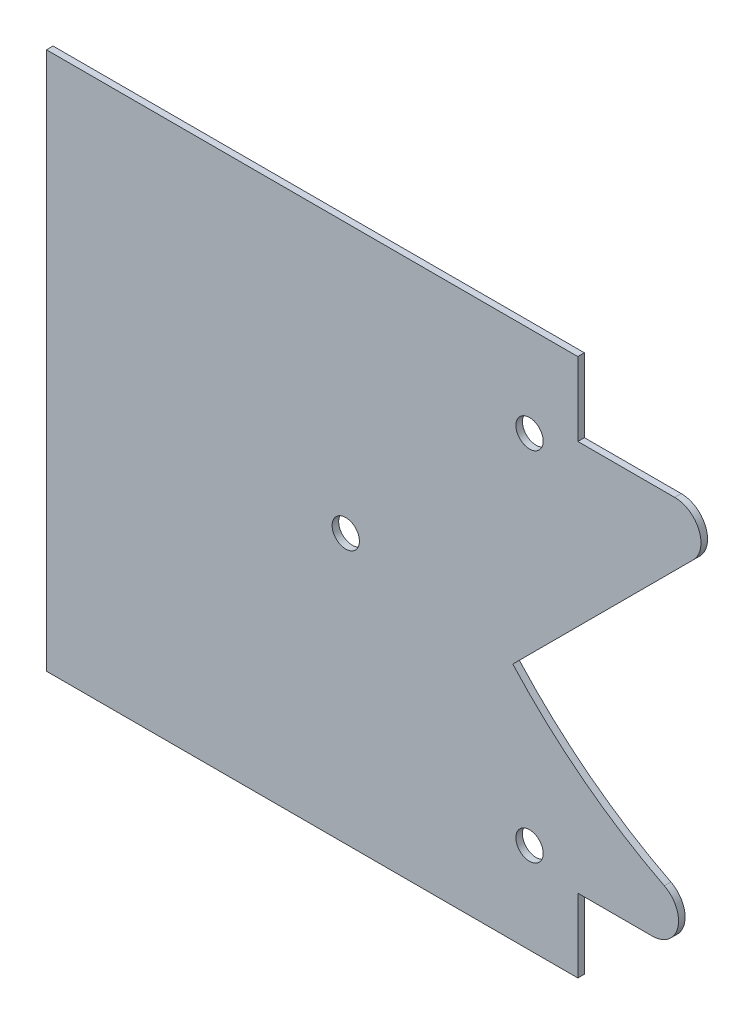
from build123d import *

# Parameters (mm, degrees)
SKETCH1_W           = 153.035
SKETCH1_H           = 65.0875
SKETCH1_R           = 24.765
SKETCH1_R_2         = 1.651
BOSS_EXTRUDE1_DEPTH = 0.79375
CUT_EXTRUDE2_DEPTH  = 110.109418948
FILLET1_R           = 2.54
SKETCH4_R           = 1.651
CUT_EXTRUDE3_DEPTH  = 110.109418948
FILLET2_R           = 3.175


with BuildPart() as part:
    # Sketch1 → Boss-Extrude1 (new body)
    with BuildSketch(Plane.XY):
        with Locations((-27.6225, 0)):
            Rectangle(SKETCH1_W, SKETCH1_H)
        Circle(SKETCH1_R, mode=Mode.SUBTRACT)
        with Locations((29.21, 28.47975)):
            Circle(SKETCH1_R_2, mode=Mode.SUBTRACT)
        with Locations((-29.21, 28.47975)):
            Circle(SKETCH1_R_2, mode=Mode.SUBTRACT)
        with Locations((-29.21, -28.47975)):
            Circle(SKETCH1_R_2, mode=Mode.SUBTRACT)
        with Locations((29.21, -28.47975)):
            Circle(SKETCH1_R_2, mode=Mode.SUBTRACT)
        with Locations((44.1325, 22.225)):
            Circle(SKETCH1_R_2, mode=Mode.SUBTRACT)
        with Locations((44.1325, -22.225)):
            Circle(SKETCH1_R_2, mode=Mode.SUBTRACT)
        with Locations((-45.72, 21.59)):
            Circle(SKETCH1_R_2, mode=Mode.SUBTRACT)
        with Locations((-45.72, -21.59)):
            Circle(SKETCH1_R_2, mode=Mode.SUBTRACT)
    extrude(amount=BOSS_EXTRUDE1_DEPTH)

    # Sketch2 → Cut-Extrude2 (cut, through all)
    with BuildSketch(Plane.XY.offset(0.79375)):
        with BuildLine():
            Line((0, 39.65575), (64.42075, 39.65575))
            ThreePointArc((64.42075, 39.65575), (24.652753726, -19.861262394), (-45.552349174, -5.896599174))
            ThreePointArc((-45.552349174, -5.896599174), (-46.661380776, -4.759884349), (-47.74205517, -3.59617711))
            Line((-47.74205517, -3.59617711), (-4.490128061, 39.65575))
            Line((-4.490128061, 39.65575), (0, 39.65575))
        make_face()
    extrude(amount=-CUT_EXTRUDE2_DEPTH, mode=Mode.SUBTRACT)

    # Fillet1
    fillet1_edges = [part.edges().sort_by_distance(p)[0] for p in [
        (-11.602128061, 32.54375, 0.396875),
        (48.895, -2.288403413, 0.396875),
    ]]
    fillet(fillet1_edges, radius=FILLET1_R)

    # Sketch4 → Cut-Extrude3 (cut, through all)
    # profile 1 of 3: a face of its own
    with BuildSketch(Plane.XY):
        with BuildLine():
            Line((-17.734230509, 32.54375), (-39.878, 32.54375))
            Line((-39.878, 32.54375), (-39.878, 23.65375))
            Line((-39.878, 23.65375), (-20.492128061, 23.65375))
            Line((-20.492128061, 23.65375), (-15.938179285, 28.207698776))
            ThreePointArc((-15.938179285, 28.207698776), (-15.387576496, 30.975765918), (-17.734230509, 32.54375))
        make_face()
        with Locations((-29.21, 28.47975)):
            Circle(SKETCH4_R, mode=Mode.SUBTRACT)
    # profile 2 of 3: a face of its own
    with BuildSketch(Plane.XY):
        with BuildLine():
            Line((48.895, -32.54375), (48.895, -8.665632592))
            ThreePointArc((48.895, -8.665632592), (47.351329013, -6.329197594), (44.596631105, -6.832673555))
            ThreePointArc((44.596631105, -6.832673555), (18.378735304, -22.087712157), (-11.913867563, -23.65375))
            Line((-11.913867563, -23.65375), (-39.878, -23.65375))
            Line((-39.878, -23.65375), (-39.878, -32.54375))
            Line((-39.878, -32.54375), (48.895, -32.54375))
        make_face()
        with Locations((-29.21, -28.47975)):
            Circle(SKETCH4_R, mode=Mode.SUBTRACT)
        with Locations((29.21, -28.47975)):
            Circle(SKETCH4_R, mode=Mode.SUBTRACT)
        with Locations((44.1325, -22.225)):
            Circle(SKETCH4_R, mode=Mode.SUBTRACT)
    # profile 3 of 3: a face of its own
    with BuildSketch(Plane.XY):
        with Locations((-67.945, 0)):
            Circle(SKETCH4_R)
    extrude(amount=CUT_EXTRUDE3_DEPTH, mode=Mode.SUBTRACT)

    # Fillet2
    fillet2_edges = [part.edges().sort_by_distance(p)[0] for p in [
        (-11.913867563, -23.65375, 0.396875),
        (-20.492128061, 23.65375, 0.396875),
    ]]
    fillet(fillet2_edges, radius=FILLET2_R)


solid = part.part
